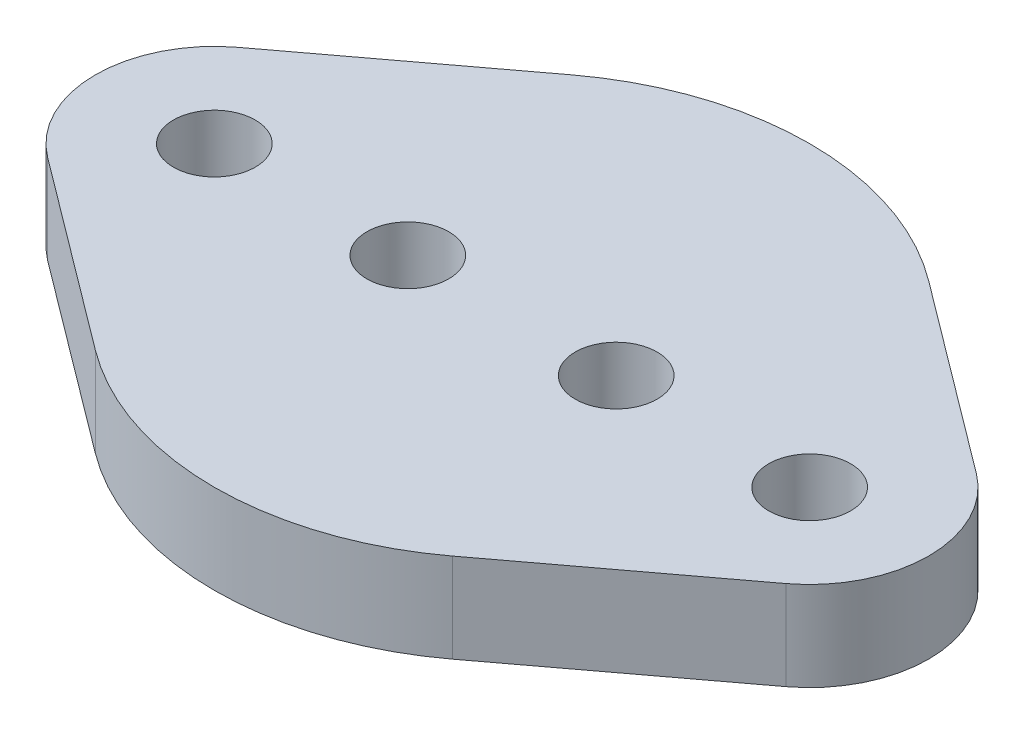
from build123d import *

# Parameters (mm, degrees)
SKETCH1_R      = 2.75
EXTRUDE1_DEPTH = 6


with BuildPart() as part:
    # Sketch1 → Extrude1 (new body)
    with BuildSketch(Plane(origin=(0, 0, 0), x_dir=(1, 0, 0), z_dir=(0, 1, 0))):
        with BuildLine():
            Line((12, 16), (24.8, 6.4))
            ThreePointArc((24.8, 6.4), (28, 0), (24.8, -6.4))
            Line((24.8, -6.4), (12, -16))
            ThreePointArc((12, -16), (0, -20), (-12, -16))
            Line((-12, -16), (-24.8, -6.4))
            ThreePointArc((-24.8, -6.4), (-28, 0), (-24.8, 6.4))
            Line((-24.8, 6.4), (-12, 16))
            ThreePointArc((-12, 16), (0, 20), (12, 16))
        make_face()
        with Locations(Location((7, 0, 0), (0, 0, 270))):
            Circle(SKETCH1_R, mode=Mode.SUBTRACT)
        with Locations(Location((20, 0, 0), (0, 0, 270))):
            Circle(SKETCH1_R, mode=Mode.SUBTRACT)
        with Locations(Location((-20, 0, 0), (0, 0, 90))):
            Circle(SKETCH1_R, mode=Mode.SUBTRACT)
        with Locations(Location((-7, 0, 0), (0, 0, 90))):
            Circle(SKETCH1_R, mode=Mode.SUBTRACT)
    extrude(amount=EXTRUDE1_DEPTH)


solid = part.part
